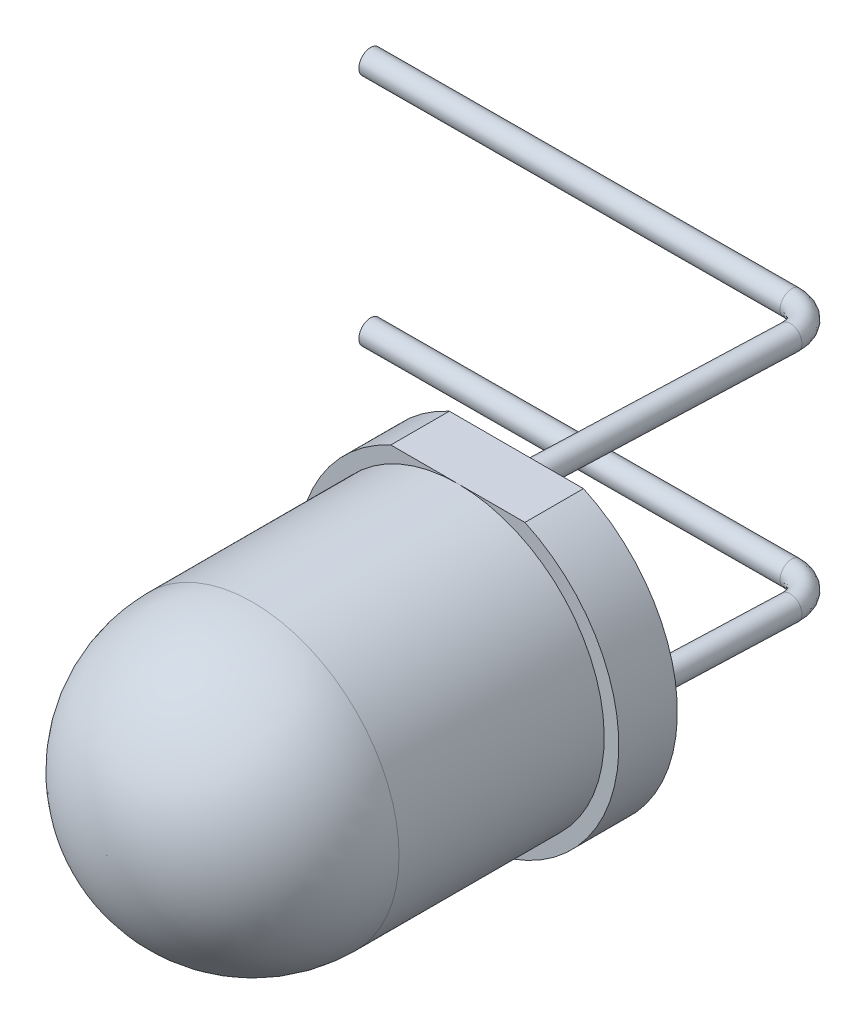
from build123d import *

# Parameters (mm, degrees)
ESQUISSE1_R             = 5
BASE_EXTRUSION_DEPTH    = 14
CONG_1_R                = 4.99
ESQUISSE2_R             = 5.5
BOSS_EXTRU_1_DEPTH      = 2
ESQUISSE4_R             = 0.4
ESQUISSE6_R             = 0.4
ESQUISSE7_W             = 9.209889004
ESQUISSE7_H             = 3.6455245
ENL_V_MAT_EXTRU_1_DEPTH = 12


with BuildPart() as part:
    # Esquisse1 → Base-Extrusion (new body)
    with BuildSketch(Plane.XY):
        Circle(ESQUISSE1_R)
    extrude(amount=BASE_EXTRUSION_DEPTH)

    # Cong_1
    cong_1_edges = [part.edges().sort_by_distance(p)[0] for p in [
        (-5, 0, 14),
    ]]
    fillet(cong_1_edges, radius=CONG_1_R)

    # Esquisse2 → Boss.-Extru.1 (add)
    with BuildSketch(Plane(origin=(0, 0, 0), x_dir=(-1, 0, 0), z_dir=(0, 0, -1))):
        Circle(ESQUISSE2_R)
    extrude(amount=-BOSS_EXTRU_1_DEPTH)

    # Boss.-Balayage1: sweep along a path in Esquisse3
    with BuildLine(Plane(origin=(0, 4, 0), x_dir=(-1, 0, 0), z_dir=(0, 1, 0))) as boss_balayage1_path:
        Line((0, 0), (-0.335644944, -9.021077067))
        ThreePointArc((-0.335644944, -9.021077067), (-0.055057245, -9.753556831), (0.667727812, -10.058249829))
        Line((0.667727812, -10.058249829), (15, -10))
    # Esquisse4 → Boss.-Balayage1 (sweep)
    with BuildSketch(Plane(origin=(0, 0, 0), x_dir=(-1, 0, 0), z_dir=(0, 0, -1))):
        with Locations((0, 4)):
            Circle(ESQUISSE4_R)
    sweep(path=boss_balayage1_path.line)

    # Boss.-Balayage2: sweep along a path in Esquisse5
    with BuildLine(Plane(origin=(0, -4, 0), x_dir=(-1, 0, 0), z_dir=(0, 1, 0))) as boss_balayage2_path:
        Line((0, 0), (-0.335644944, -9.021077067))
        ThreePointArc((-0.335644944, -9.021077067), (-0.055057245, -9.753556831), (0.667727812, -10.058249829))
        Line((0.667727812, -10.058249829), (15, -10))
    # Esquisse6 → Boss.-Balayage2 (sweep)
    with BuildSketch(Plane(origin=(0, 0, 0), x_dir=(-1, 0, 0), z_dir=(0, 0, -1))):
        with Locations((0, -4)):
            Circle(ESQUISSE6_R)
    sweep(path=boss_balayage2_path.line)

    # Esquisse7 → Enl_v. mat.-Extru.1 (cut)
    with BuildSketch(Plane(origin=(0, 0, 0), x_dir=(-1, 0, 0), z_dir=(0, 0, -1))):
        with Locations((0.444559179, 6.82276225)):
            Rectangle(ESQUISSE7_W, ESQUISSE7_H)
    extrude(amount=-ENL_V_MAT_EXTRU_1_DEPTH, mode=Mode.SUBTRACT)


solid = part.part
